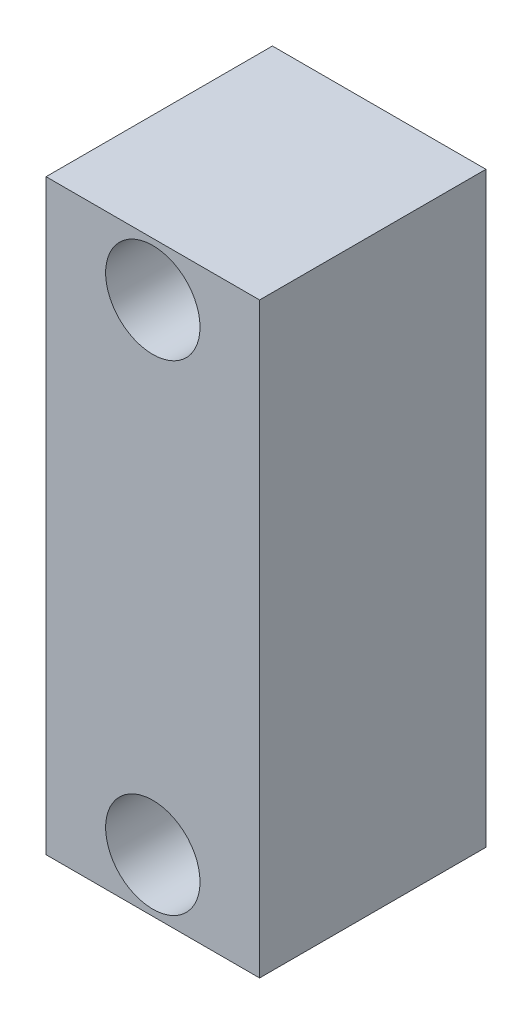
from build123d import *

# Parameters (mm, degrees)
SKETCH1_W                      = 25.4
SKETCH1_H                      = 69.85
EXTRUDE1_DEPTH                 = 13.462
CBORE_FOR_M8_SHCS1_D           = 9
CBORE_FOR_M8_SHCS1_CBORE_D     = 11.2268
CBORE_FOR_M8_SHCS1_CBORE_DEPTH = 8


with BuildPart() as part:
    # Sketch1 → Extrude1 (new, symmetric)
    with BuildSketch(Plane.XY):
        Rectangle(SKETCH1_W, SKETCH1_H)
    extrude(amount=EXTRUDE1_DEPTH, both=True)

    # CBORE for M8 SHCS1 (through all)
    with Locations(Plane.XY.offset(13.462)):
        with Locations((0, 28.575), (0, -28.575)):
            CounterBoreHole(CBORE_FOR_M8_SHCS1_D / 2, CBORE_FOR_M8_SHCS1_CBORE_D / 2, CBORE_FOR_M8_SHCS1_CBORE_DEPTH)


solid = part.part
